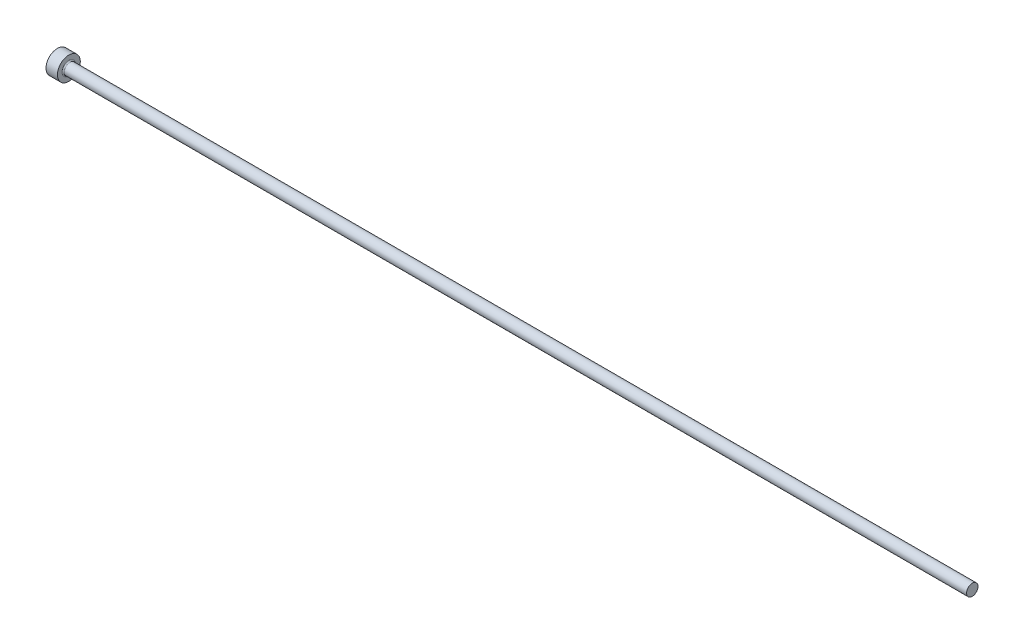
ISO-10303-21;
HEADER;
FILE_DESCRIPTION(('STEP AP214'),'2;1');
FILE_NAME('part.step','',(''),(''),'','','');
FILE_SCHEMA(('AUTOMOTIVE_DESIGN { 1 0 10303 214 1 1 1 1 }'));
ENDSEC;
DATA;
#1=APPLICATION_CONTEXT('core data for automotive mechanical design processes');
#2=APPLICATION_PROTOCOL_DEFINITION('international standard','automotive_design',2000,#1);
#3=PRODUCT_CONTEXT('',#1,'mechanical');
#4=PRODUCT('Part','Part','',(#3));
#5=PRODUCT_RELATED_PRODUCT_CATEGORY('part','',(#4));
#6=PRODUCT_DEFINITION_FORMATION('','',#4);
#7=PRODUCT_DEFINITION_CONTEXT('part definition',#1,'design');
#8=PRODUCT_DEFINITION('design','',#6,#7);
#9=PRODUCT_DEFINITION_SHAPE('','',#8);
#10=(LENGTH_UNIT() NAMED_UNIT(*) SI_UNIT(.MILLI.,.METRE.));
#11=(NAMED_UNIT(*) PLANE_ANGLE_UNIT() SI_UNIT($,.RADIAN.));
#12=(NAMED_UNIT(*) SI_UNIT($,.STERADIAN.) SOLID_ANGLE_UNIT());
#13=UNCERTAINTY_MEASURE_WITH_UNIT(LENGTH_MEASURE(1.E-05),#10,'distance_accuracy_value','');
#14=(GEOMETRIC_REPRESENTATION_CONTEXT(3) GLOBAL_UNCERTAINTY_ASSIGNED_CONTEXT((#13)) GLOBAL_UNIT_ASSIGNED_CONTEXT((#10,
#11,#12)) REPRESENTATION_CONTEXT('',''));
#15=CARTESIAN_POINT('',(0.,0.,0.));
#16=DIRECTION('',(0.,0.,1.));
#17=DIRECTION('',(1.,0.,0.));
#18=AXIS2_PLACEMENT_3D('',#15,#16,#17);
#19=CARTESIAN_POINT('',(0.,0.,0.));
#20=DIRECTION('',(-1.,0.,0.));
#21=DIRECTION('',(0.,-1.,0.));
#22=AXIS2_PLACEMENT_3D('',#19,#20,#21);
#23=PLANE('',#22);
#24=CARTESIAN_POINT('',(0.,0.,0.));
#25=DIRECTION('',(1.,0.,0.));
#26=DIRECTION('',(0.,1.,0.));
#27=AXIS2_PLACEMENT_3D('',#24,#25,#26);
#28=CIRCLE('',#27,2.);
#29=CARTESIAN_POINT('',(0.,2.,0.));
#30=VERTEX_POINT('',#29);
#31=EDGE_CURVE('E25',#30,#30,#28,.T.);
#32=ORIENTED_EDGE('',*,*,#31,.F.);
#33=EDGE_LOOP('',(#32));
#34=FACE_BOUND('',#33,.T.);
#35=ADVANCED_FACE('F14',(#34),#23,.T.);
#36=CARTESIAN_POINT('',(160.,0.,0.));
#37=DIRECTION('',(1.,0.,0.));
#38=DIRECTION('',(0.,1.,0.));
#39=AXIS2_PLACEMENT_3D('',#36,#37,#38);
#40=CYLINDRICAL_SURFACE('',#39,2.);
#41=ORIENTED_EDGE('',*,*,#31,.T.);
#42=EDGE_LOOP('',(#41));
#43=FACE_BOUND('',#42,.T.);
#44=CARTESIAN_POINT('',(2.,0.,0.));
#45=DIRECTION('',(1.,0.,0.));
#46=DIRECTION('',(0.,1.,0.));
#47=AXIS2_PLACEMENT_3D('',#44,#45,#46);
#48=CIRCLE('',#47,2.);
#49=CARTESIAN_POINT('',(2.,2.,0.));
#50=VERTEX_POINT('',#49);
#51=EDGE_CURVE('E29',#50,#50,#48,.T.);
#52=ORIENTED_EDGE('',*,*,#51,.F.);
#53=EDGE_LOOP('',(#52));
#54=FACE_BOUND('',#53,.T.);
#55=ADVANCED_FACE('F51',(#43,#54),#40,.T.);
#56=CARTESIAN_POINT('',(2.,2.,0.));
#57=DIRECTION('',(1.,0.,0.));
#58=DIRECTION('',(0.,1.,0.));
#59=AXIS2_PLACEMENT_3D('',#56,#57,#58);
#60=PLANE('',#59);
#61=CARTESIAN_POINT('',(2.,0.,0.));
#62=DIRECTION('',(1.,0.,0.));
#63=DIRECTION('',(0.,1.,0.));
#64=AXIS2_PLACEMENT_3D('',#61,#62,#63);
#65=CIRCLE('',#64,1.19999999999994);
#66=CARTESIAN_POINT('',(2.,1.19999999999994,0.));
#67=VERTEX_POINT('',#66);
#68=EDGE_CURVE('E9',#67,#67,#65,.F.);
#69=ORIENTED_EDGE('',*,*,#68,.T.);
#70=EDGE_LOOP('',(#69));
#71=FACE_BOUND('',#70,.T.);
#72=ORIENTED_EDGE('',*,*,#51,.T.);
#73=EDGE_LOOP('',(#72));
#74=FACE_BOUND('',#73,.T.);
#75=ADVANCED_FACE('F42',(#71,#74),#60,.T.);
#76=CARTESIAN_POINT('',(160.,0.,0.));
#77=DIRECTION('',(1.,0.,0.));
#78=DIRECTION('',(0.,1.,0.));
#79=AXIS2_PLACEMENT_3D('',#76,#77,#78);
#80=CYLINDRICAL_SURFACE('',#79,0.999999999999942);
#81=CARTESIAN_POINT('',(2.2,0.,0.));
#82=DIRECTION('',(1.,0.,0.));
#83=DIRECTION('',(0.,1.,0.));
#84=AXIS2_PLACEMENT_3D('',#81,#82,#83);
#85=CIRCLE('',#84,0.999999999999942);
#86=CARTESIAN_POINT('',(2.2,0.999999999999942,0.));
#87=VERTEX_POINT('',#86);
#88=EDGE_CURVE('E21',#87,#87,#85,.T.);
#89=ORIENTED_EDGE('',*,*,#88,.T.);
#90=EDGE_LOOP('',(#89));
#91=FACE_BOUND('',#90,.T.);
#92=CARTESIAN_POINT('',(160.,0.,0.));
#93=DIRECTION('',(1.,0.,0.));
#94=DIRECTION('',(0.,1.,0.));
#95=AXIS2_PLACEMENT_3D('',#92,#93,#94);
#96=CIRCLE('',#95,0.999999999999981);
#97=CARTESIAN_POINT('',(160.,0.999999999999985,0.));
#98=VERTEX_POINT('',#97);
#99=EDGE_CURVE('E34',#98,#98,#96,.T.);
#100=ORIENTED_EDGE('',*,*,#99,.F.);
#101=EDGE_LOOP('',(#100));
#102=FACE_BOUND('',#101,.T.);
#103=ADVANCED_FACE('F40',(#91,#102),#80,.T.);
#104=CARTESIAN_POINT('',(160.,0.999999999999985,0.));
#105=DIRECTION('',(1.,0.,0.));
#106=DIRECTION('',(0.,1.,0.));
#107=AXIS2_PLACEMENT_3D('',#104,#105,#106);
#108=PLANE('',#107);
#109=ORIENTED_EDGE('',*,*,#99,.T.);
#110=EDGE_LOOP('',(#109));
#111=FACE_BOUND('',#110,.T.);
#112=ADVANCED_FACE('F38',(#111),#108,.T.);
#113=CARTESIAN_POINT('',(2.2,0.,0.));
#114=DIRECTION('',(1.,0.,0.));
#115=DIRECTION('',(0.,1.,0.));
#116=AXIS2_PLACEMENT_3D('',#113,#114,#115);
#117=TOROIDAL_SURFACE('',#116,1.19999999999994,0.2);
#118=ORIENTED_EDGE('',*,*,#68,.F.);
#119=EDGE_LOOP('',(#118));
#120=FACE_BOUND('',#119,.T.);
#121=ORIENTED_EDGE('',*,*,#88,.F.);
#122=EDGE_LOOP('',(#121));
#123=FACE_BOUND('',#122,.T.);
#124=ADVANCED_FACE('F16',(#120,#123),#117,.F.);
#125=CLOSED_SHELL('',(#35,#55,#75,#103,#112,#124));
#126=MANIFOLD_SOLID_BREP('B1',#125);
#127=ADVANCED_BREP_SHAPE_REPRESENTATION('',(#18,#126),#14);
#128=SHAPE_DEFINITION_REPRESENTATION(#9,#127);
ENDSEC;
END-ISO-10303-21;
